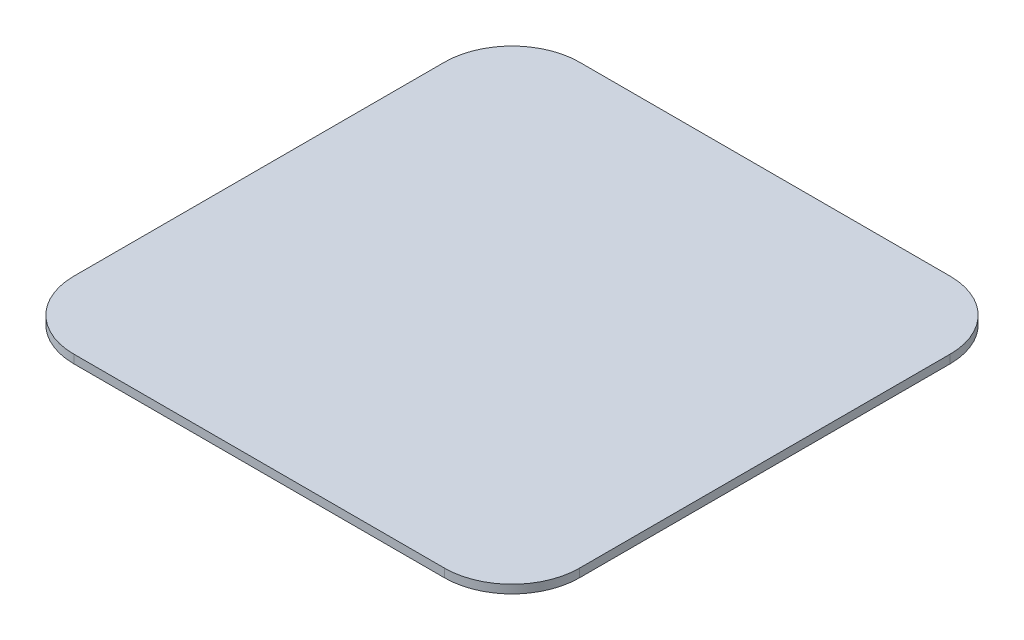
ISO-10303-21;
HEADER;
FILE_DESCRIPTION(('STEP AP214'),'2;1');
FILE_NAME('part.step','',(''),(''),'','','');
FILE_SCHEMA(('AUTOMOTIVE_DESIGN { 1 0 10303 214 1 1 1 1 }'));
ENDSEC;
DATA;
#1=APPLICATION_CONTEXT('core data for automotive mechanical design processes');
#2=APPLICATION_PROTOCOL_DEFINITION('international standard','automotive_design',2000,#1);
#3=PRODUCT_CONTEXT('',#1,'mechanical');
#4=PRODUCT('Part','Part','',(#3));
#5=PRODUCT_RELATED_PRODUCT_CATEGORY('part','',(#4));
#6=PRODUCT_DEFINITION_FORMATION('','',#4);
#7=PRODUCT_DEFINITION_CONTEXT('part definition',#1,'design');
#8=PRODUCT_DEFINITION('design','',#6,#7);
#9=PRODUCT_DEFINITION_SHAPE('','',#8);
#10=(LENGTH_UNIT() NAMED_UNIT(*) SI_UNIT(.MILLI.,.METRE.));
#11=(NAMED_UNIT(*) PLANE_ANGLE_UNIT() SI_UNIT($,.RADIAN.));
#12=(NAMED_UNIT(*) SI_UNIT($,.STERADIAN.) SOLID_ANGLE_UNIT());
#13=UNCERTAINTY_MEASURE_WITH_UNIT(LENGTH_MEASURE(1.E-05),#10,'distance_accuracy_value','');
#14=(GEOMETRIC_REPRESENTATION_CONTEXT(3) GLOBAL_UNCERTAINTY_ASSIGNED_CONTEXT((#13)) GLOBAL_UNIT_ASSIGNED_CONTEXT((#10,
#11,#12)) REPRESENTATION_CONTEXT('',''));
#15=CARTESIAN_POINT('',(0.,0.,0.));
#16=DIRECTION('',(0.,0.,1.));
#17=DIRECTION('',(1.,0.,0.));
#18=AXIS2_PLACEMENT_3D('',#15,#16,#17);
#19=CARTESIAN_POINT('',(150.,5.,-150.));
#20=DIRECTION('',(-1.,0.,0.));
#21=DIRECTION('',(0.,0.,1.));
#22=AXIS2_PLACEMENT_3D('',#19,#20,#21);
#23=PLANE('',#22);
#24=DIRECTION('',(0.,0.,-1.));
#25=VECTOR('',#24,1.);
#26=CARTESIAN_POINT('',(150.,0.,-150.));
#27=LINE('',#26,#25);
#28=CARTESIAN_POINT('',(150.,0.,110.));
#29=VERTEX_POINT('',#28);
#30=CARTESIAN_POINT('',(150.,0.,-110.));
#31=VERTEX_POINT('',#30);
#32=EDGE_CURVE('E128',#29,#31,#27,.T.);
#33=ORIENTED_EDGE('',*,*,#32,.T.);
#34=DIRECTION('',(0.,-1.,0.));
#35=VECTOR('',#34,1.);
#36=CARTESIAN_POINT('',(150.,5.,-110.));
#37=LINE('',#36,#35);
#38=CARTESIAN_POINT('',(150.,5.,-110.));
#39=VERTEX_POINT('',#38);
#40=EDGE_CURVE('E11',#31,#39,#37,.F.);
#41=ORIENTED_EDGE('',*,*,#40,.T.);
#42=DIRECTION('',(0.,0.,-1.));
#43=VECTOR('',#42,1.);
#44=CARTESIAN_POINT('',(150.,5.,-150.));
#45=LINE('',#44,#43);
#46=CARTESIAN_POINT('',(150.,5.,110.));
#47=VERTEX_POINT('',#46);
#48=EDGE_CURVE('E126',#47,#39,#45,.T.);
#49=ORIENTED_EDGE('',*,*,#48,.F.);
#50=DIRECTION('',(0.,-1.,0.));
#51=VECTOR('',#50,1.);
#52=CARTESIAN_POINT('',(150.,5.,110.));
#53=LINE('',#52,#51);
#54=EDGE_CURVE('E40',#47,#29,#53,.T.);
#55=ORIENTED_EDGE('',*,*,#54,.T.);
#56=EDGE_LOOP('',(#33,#41,#49,#55));
#57=FACE_BOUND('',#56,.T.);
#58=ADVANCED_FACE('F32',(#57),#23,.F.);
#59=CARTESIAN_POINT('',(-150.,5.,-150.));
#60=DIRECTION('',(0.,0.,1.));
#61=DIRECTION('',(1.,0.,0.));
#62=AXIS2_PLACEMENT_3D('',#59,#60,#61);
#63=PLANE('',#62);
#64=DIRECTION('',(-1.,0.,0.));
#65=VECTOR('',#64,1.);
#66=CARTESIAN_POINT('',(-150.,0.,-150.));
#67=LINE('',#66,#65);
#68=CARTESIAN_POINT('',(110.,0.,-150.));
#69=VERTEX_POINT('',#68);
#70=CARTESIAN_POINT('',(-110.,0.,-150.));
#71=VERTEX_POINT('',#70);
#72=EDGE_CURVE('E124',#69,#71,#67,.T.);
#73=ORIENTED_EDGE('',*,*,#72,.T.);
#74=DIRECTION('',(0.,-1.,0.));
#75=VECTOR('',#74,1.);
#76=CARTESIAN_POINT('',(-110.,5.,-150.));
#77=LINE('',#76,#75);
#78=CARTESIAN_POINT('',(-110.,5.,-150.));
#79=VERTEX_POINT('',#78);
#80=EDGE_CURVE('E103',#71,#79,#77,.F.);
#81=ORIENTED_EDGE('',*,*,#80,.T.);
#82=DIRECTION('',(-1.,0.,0.));
#83=VECTOR('',#82,1.);
#84=CARTESIAN_POINT('',(-150.,5.,-150.));
#85=LINE('',#84,#83);
#86=CARTESIAN_POINT('',(110.,5.,-150.));
#87=VERTEX_POINT('',#86);
#88=EDGE_CURVE('E164',#87,#79,#85,.T.);
#89=ORIENTED_EDGE('',*,*,#88,.F.);
#90=DIRECTION('',(0.,-1.,0.));
#91=VECTOR('',#90,1.);
#92=CARTESIAN_POINT('',(110.,5.,-150.));
#93=LINE('',#92,#91);
#94=EDGE_CURVE('E108',#87,#69,#93,.T.);
#95=ORIENTED_EDGE('',*,*,#94,.T.);
#96=EDGE_LOOP('',(#73,#81,#89,#95));
#97=FACE_BOUND('',#96,.T.);
#98=ADVANCED_FACE('F174',(#97),#63,.F.);
#99=CARTESIAN_POINT('',(-150.,5.,-150.));
#100=DIRECTION('',(1.,0.,0.));
#101=DIRECTION('',(0.,0.,-1.));
#102=AXIS2_PLACEMENT_3D('',#99,#100,#101);
#103=PLANE('',#102);
#104=DIRECTION('',(0.,0.,1.));
#105=VECTOR('',#104,1.);
#106=CARTESIAN_POINT('',(-150.,5.,-150.));
#107=LINE('',#106,#105);
#108=CARTESIAN_POINT('',(-150.,5.,-110.));
#109=VERTEX_POINT('',#108);
#110=CARTESIAN_POINT('',(-150.,5.,110.));
#111=VERTEX_POINT('',#110);
#112=EDGE_CURVE('E117',#109,#111,#107,.T.);
#113=ORIENTED_EDGE('',*,*,#112,.F.);
#114=DIRECTION('',(0.,-1.,0.));
#115=VECTOR('',#114,1.);
#116=CARTESIAN_POINT('',(-150.,5.,-110.));
#117=LINE('',#116,#115);
#118=CARTESIAN_POINT('',(-150.,0.,-110.));
#119=VERTEX_POINT('',#118);
#120=EDGE_CURVE('E102',#109,#119,#117,.T.);
#121=ORIENTED_EDGE('',*,*,#120,.T.);
#122=DIRECTION('',(0.,0.,1.));
#123=VECTOR('',#122,1.);
#124=CARTESIAN_POINT('',(-150.,0.,-150.));
#125=LINE('',#124,#123);
#126=CARTESIAN_POINT('',(-150.,0.,110.));
#127=VERTEX_POINT('',#126);
#128=EDGE_CURVE('E115',#119,#127,#125,.T.);
#129=ORIENTED_EDGE('',*,*,#128,.T.);
#130=DIRECTION('',(0.,-1.,0.));
#131=VECTOR('',#130,1.);
#132=CARTESIAN_POINT('',(-150.,5.,110.));
#133=LINE('',#132,#131);
#134=EDGE_CURVE('E119',#127,#111,#133,.F.);
#135=ORIENTED_EDGE('',*,*,#134,.T.);
#136=EDGE_LOOP('',(#113,#121,#129,#135));
#137=FACE_BOUND('',#136,.T.);
#138=ADVANCED_FACE('F114',(#137),#103,.F.);
#139=CARTESIAN_POINT('',(-150.,5.,150.));
#140=DIRECTION('',(0.,0.,-1.));
#141=DIRECTION('',(-1.,0.,0.));
#142=AXIS2_PLACEMENT_3D('',#139,#140,#141);
#143=PLANE('',#142);
#144=DIRECTION('',(1.,0.,0.));
#145=VECTOR('',#144,1.);
#146=CARTESIAN_POINT('',(-150.,5.,150.));
#147=LINE('',#146,#145);
#148=CARTESIAN_POINT('',(-110.,5.,150.));
#149=VERTEX_POINT('',#148);
#150=CARTESIAN_POINT('',(110.,5.,150.));
#151=VERTEX_POINT('',#150);
#152=EDGE_CURVE('E132',#149,#151,#147,.T.);
#153=ORIENTED_EDGE('',*,*,#152,.F.);
#154=DIRECTION('',(0.,-1.,0.));
#155=VECTOR('',#154,1.);
#156=CARTESIAN_POINT('',(-110.,5.,150.));
#157=LINE('',#156,#155);
#158=CARTESIAN_POINT('',(-110.,0.,150.));
#159=VERTEX_POINT('',#158);
#160=EDGE_CURVE('E149',#149,#159,#157,.T.);
#161=ORIENTED_EDGE('',*,*,#160,.T.);
#162=DIRECTION('',(1.,0.,0.));
#163=VECTOR('',#162,1.);
#164=CARTESIAN_POINT('',(-150.,0.,150.));
#165=LINE('',#164,#163);
#166=CARTESIAN_POINT('',(110.,0.,150.));
#167=VERTEX_POINT('',#166);
#168=EDGE_CURVE('E123',#159,#167,#165,.T.);
#169=ORIENTED_EDGE('',*,*,#168,.T.);
#170=DIRECTION('',(0.,-1.,0.));
#171=VECTOR('',#170,1.);
#172=CARTESIAN_POINT('',(110.,5.,150.));
#173=LINE('',#172,#171);
#174=EDGE_CURVE('E47',#167,#151,#173,.F.);
#175=ORIENTED_EDGE('',*,*,#174,.T.);
#176=EDGE_LOOP('',(#153,#161,#169,#175));
#177=FACE_BOUND('',#176,.T.);
#178=ADVANCED_FACE('F178',(#177),#143,.F.);
#179=CARTESIAN_POINT('',(0.,5.,0.));
#180=DIRECTION('',(0.,1.,0.));
#181=DIRECTION('',(0.,0.,1.));
#182=AXIS2_PLACEMENT_3D('',#179,#180,#181);
#183=PLANE('',#182);
#184=ORIENTED_EDGE('',*,*,#88,.T.);
#185=CARTESIAN_POINT('',(-110.,5.,-110.));
#186=DIRECTION('',(0.,1.,0.));
#187=DIRECTION('',(0.,0.,1.));
#188=AXIS2_PLACEMENT_3D('',#185,#186,#187);
#189=CIRCLE('',#188,40.);
#190=EDGE_CURVE('E146',#79,#109,#189,.T.);
#191=ORIENTED_EDGE('',*,*,#190,.T.);
#192=ORIENTED_EDGE('',*,*,#112,.T.);
#193=CARTESIAN_POINT('',(-110.,5.,110.));
#194=DIRECTION('',(0.,1.,0.));
#195=DIRECTION('',(0.,0.,1.));
#196=AXIS2_PLACEMENT_3D('',#193,#194,#195);
#197=CIRCLE('',#196,40.);
#198=EDGE_CURVE('E54',#111,#149,#197,.T.);
#199=ORIENTED_EDGE('',*,*,#198,.T.);
#200=ORIENTED_EDGE('',*,*,#152,.T.);
#201=CARTESIAN_POINT('',(110.,5.,110.));
#202=DIRECTION('',(0.,1.,0.));
#203=DIRECTION('',(0.,0.,1.));
#204=AXIS2_PLACEMENT_3D('',#201,#202,#203);
#205=CIRCLE('',#204,40.);
#206=EDGE_CURVE('E141',#151,#47,#205,.T.);
#207=ORIENTED_EDGE('',*,*,#206,.T.);
#208=ORIENTED_EDGE('',*,*,#48,.T.);
#209=CARTESIAN_POINT('',(110.,5.,-110.));
#210=DIRECTION('',(0.,1.,0.));
#211=DIRECTION('',(0.,0.,1.));
#212=AXIS2_PLACEMENT_3D('',#209,#210,#211);
#213=CIRCLE('',#212,40.);
#214=EDGE_CURVE('E143',#39,#87,#213,.T.);
#215=ORIENTED_EDGE('',*,*,#214,.T.);
#216=EDGE_LOOP('',(#184,#191,#192,#199,#200,#207,#208,#215));
#217=FACE_BOUND('',#216,.T.);
#218=ADVANCED_FACE('F168',(#217),#183,.T.);
#219=CARTESIAN_POINT('',(0.,0.,0.));
#220=DIRECTION('',(0.,1.,0.));
#221=DIRECTION('',(0.,0.,1.));
#222=AXIS2_PLACEMENT_3D('',#219,#220,#221);
#223=PLANE('',#222);
#224=ORIENTED_EDGE('',*,*,#128,.F.);
#225=CARTESIAN_POINT('',(-110.,0.,-110.));
#226=DIRECTION('',(0.,1.,0.));
#227=DIRECTION('',(0.,0.,1.));
#228=AXIS2_PLACEMENT_3D('',#225,#226,#227);
#229=CIRCLE('',#228,40.);
#230=EDGE_CURVE('E98',#119,#71,#229,.F.);
#231=ORIENTED_EDGE('',*,*,#230,.T.);
#232=ORIENTED_EDGE('',*,*,#72,.F.);
#233=CARTESIAN_POINT('',(110.,0.,-110.));
#234=DIRECTION('',(0.,1.,0.));
#235=DIRECTION('',(0.,0.,1.));
#236=AXIS2_PLACEMENT_3D('',#233,#234,#235);
#237=CIRCLE('',#236,40.);
#238=EDGE_CURVE('E135',#69,#31,#237,.F.);
#239=ORIENTED_EDGE('',*,*,#238,.T.);
#240=ORIENTED_EDGE('',*,*,#32,.F.);
#241=CARTESIAN_POINT('',(110.,0.,110.));
#242=DIRECTION('',(0.,1.,0.));
#243=DIRECTION('',(0.,0.,1.));
#244=AXIS2_PLACEMENT_3D('',#241,#242,#243);
#245=CIRCLE('',#244,40.);
#246=EDGE_CURVE('E118',#29,#167,#245,.F.);
#247=ORIENTED_EDGE('',*,*,#246,.T.);
#248=ORIENTED_EDGE('',*,*,#168,.F.);
#249=CARTESIAN_POINT('',(-110.,0.,110.));
#250=DIRECTION('',(0.,1.,0.));
#251=DIRECTION('',(0.,0.,1.));
#252=AXIS2_PLACEMENT_3D('',#249,#250,#251);
#253=CIRCLE('',#252,40.);
#254=EDGE_CURVE('E109',#159,#127,#253,.F.);
#255=ORIENTED_EDGE('',*,*,#254,.T.);
#256=EDGE_LOOP('',(#224,#231,#232,#239,#240,#247,#248,#255));
#257=FACE_BOUND('',#256,.T.);
#258=ADVANCED_FACE('F121',(#257),#223,.F.);
#259=CARTESIAN_POINT('',(-110.,5.,-110.));
#260=DIRECTION('',(0.,-1.,0.));
#261=DIRECTION('',(0.,0.,-1.));
#262=AXIS2_PLACEMENT_3D('',#259,#260,#261);
#263=CYLINDRICAL_SURFACE('',#262,40.);
#264=ORIENTED_EDGE('',*,*,#190,.F.);
#265=ORIENTED_EDGE('',*,*,#80,.F.);
#266=ORIENTED_EDGE('',*,*,#230,.F.);
#267=ORIENTED_EDGE('',*,*,#120,.F.);
#268=EDGE_LOOP('',(#264,#265,#266,#267));
#269=FACE_BOUND('',#268,.T.);
#270=ADVANCED_FACE('F101',(#269),#263,.T.);
#271=CARTESIAN_POINT('',(-110.,5.,110.));
#272=DIRECTION('',(0.,-1.,0.));
#273=DIRECTION('',(0.,0.,-1.));
#274=AXIS2_PLACEMENT_3D('',#271,#272,#273);
#275=CYLINDRICAL_SURFACE('',#274,40.);
#276=ORIENTED_EDGE('',*,*,#198,.F.);
#277=ORIENTED_EDGE('',*,*,#134,.F.);
#278=ORIENTED_EDGE('',*,*,#254,.F.);
#279=ORIENTED_EDGE('',*,*,#160,.F.);
#280=EDGE_LOOP('',(#276,#277,#278,#279));
#281=FACE_BOUND('',#280,.T.);
#282=ADVANCED_FACE('F177',(#281),#275,.T.);
#283=CARTESIAN_POINT('',(110.,5.,-110.));
#284=DIRECTION('',(0.,-1.,0.));
#285=DIRECTION('',(0.,0.,-1.));
#286=AXIS2_PLACEMENT_3D('',#283,#284,#285);
#287=CYLINDRICAL_SURFACE('',#286,40.);
#288=ORIENTED_EDGE('',*,*,#214,.F.);
#289=ORIENTED_EDGE('',*,*,#40,.F.);
#290=ORIENTED_EDGE('',*,*,#238,.F.);
#291=ORIENTED_EDGE('',*,*,#94,.F.);
#292=EDGE_LOOP('',(#288,#289,#290,#291));
#293=FACE_BOUND('',#292,.T.);
#294=ADVANCED_FACE('F172',(#293),#287,.T.);
#295=CARTESIAN_POINT('',(110.,5.,110.));
#296=DIRECTION('',(0.,-1.,0.));
#297=DIRECTION('',(0.,0.,-1.));
#298=AXIS2_PLACEMENT_3D('',#295,#296,#297);
#299=CYLINDRICAL_SURFACE('',#298,40.);
#300=ORIENTED_EDGE('',*,*,#206,.F.);
#301=ORIENTED_EDGE('',*,*,#174,.F.);
#302=ORIENTED_EDGE('',*,*,#246,.F.);
#303=ORIENTED_EDGE('',*,*,#54,.F.);
#304=EDGE_LOOP('',(#300,#301,#302,#303));
#305=FACE_BOUND('',#304,.T.);
#306=ADVANCED_FACE('F34',(#305),#299,.T.);
#307=CLOSED_SHELL('',(#58,#98,#138,#178,#218,#258,#270,#282,#294,#306));
#308=MANIFOLD_SOLID_BREP('B2',#307);
#309=ADVANCED_BREP_SHAPE_REPRESENTATION('',(#18,#308),#14);
#310=SHAPE_DEFINITION_REPRESENTATION(#9,#309);
ENDSEC;
END-ISO-10303-21;
